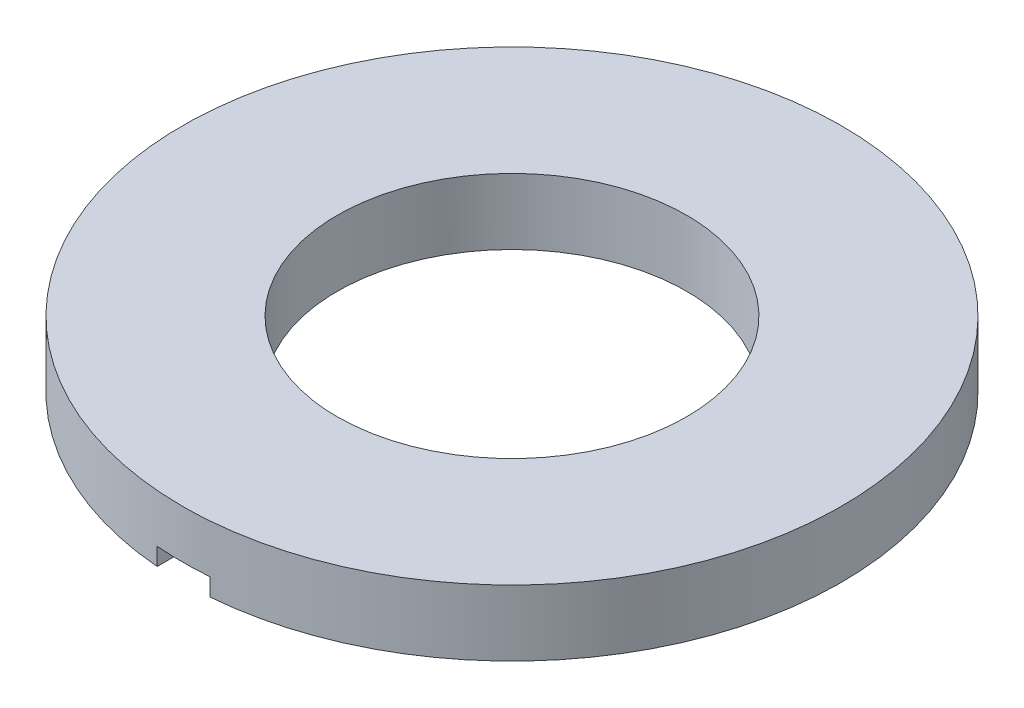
from build123d import *

# Parameters (mm, degrees)
SKETCH1_R          = 5
SKETCH1_R_2        = 2.65
EXTRUDE1_DEPTH     = 1
SKETCH2_W          = 0.8
SKETCH2_H          = 4.7
CUT_EXTRUDE1_DEPTH = 0.266666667


with BuildPart() as part:
    # Sketch1 → Extrude1 (new body)
    with BuildSketch(Plane(origin=(0, 0, 0), x_dir=(1, 0, 0), z_dir=(0, 1, 0))):
        with Locations(Location((0, 0, 0), (0, 0, 270))):
            Circle(SKETCH1_R)
        with Locations(Location((0, 0, 0), (0, 0, 270))):
            Circle(SKETCH1_R_2, mode=Mode.SUBTRACT)
    extrude(amount=EXTRUDE1_DEPTH)

    # Sketch2 → Cut-Extrude1 (cut)
    with BuildSketch(Plane.XZ):
        with Locations((0, 2.65)):
            Rectangle(SKETCH2_W, SKETCH2_H)
    extrude(amount=-CUT_EXTRUDE1_DEPTH, mode=Mode.SUBTRACT)


solid = part.part
